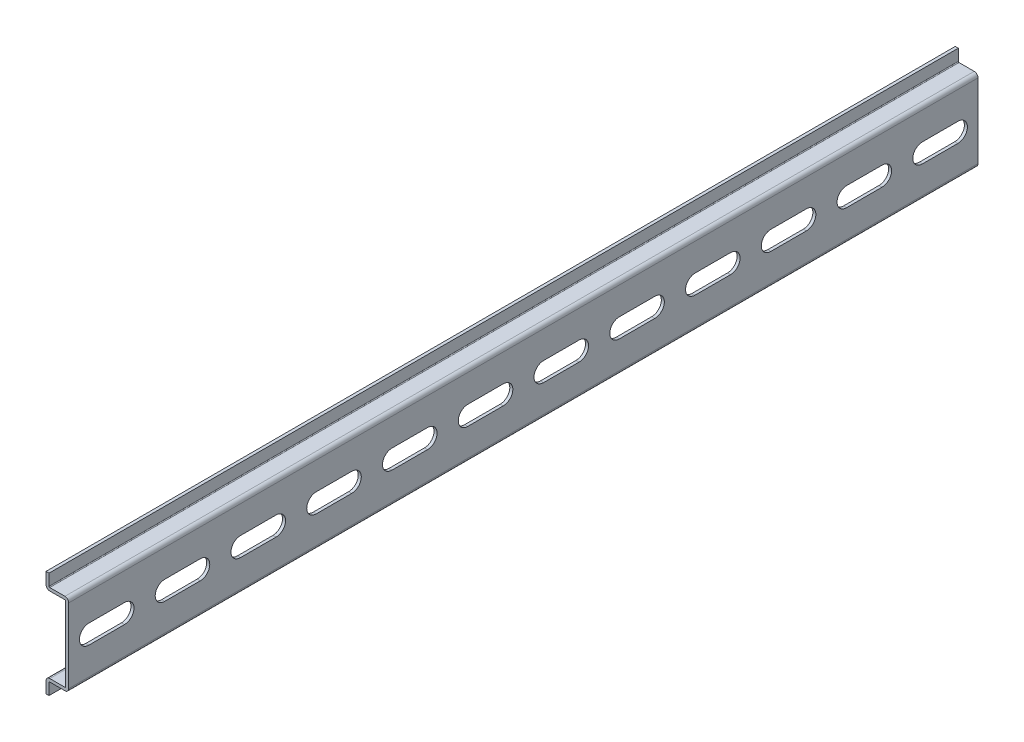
from build123d import *

# Parameters (mm, degrees)
EXTRUDE_THIN1_DEPTH = 300.0375
CUT_EXTRUDE1_DEPTH  = 301.640984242
LPATTERN1_COUNT     = 48
LPATTERN1_PITCH     = 25
FILLET1_R           = 0.25
FILLET2_R           = 1.25


with BuildPart() as part:
    # Sketch3 → Extrude-Thin1 (new body)
    with BuildSketch(Plane.XY):
        Polygon((-6.5, 17.5), (-6.5, 13.5), (0, 13.5), (0, -13.5), (-6.5, -13.5), (-6.5, -17.5), (-7.5, -17.5), (-7.5, -12.5), (-1, -12.5), (-1, 12.5), (-7.5, 12.5), (-7.5, 17.5), align=None)
    extrude(amount=EXTRUDE_THIN1_DEPTH)

    # Sketch4 → Cut-Extrude1 (cut, symmetric)
    with BuildSketch(Plane(origin=(0, 0, 0), x_dir=(0, 0, -1), z_dir=(1, 0, 0))):
        with BuildLine():
            Line((-6.65, -3.15), (-18.35, -3.15))
            ThreePointArc((-18.35, -3.15), (-21.5, 0), (-18.35, 3.15))
            Line((-18.35, 3.15), (-6.65, 3.15))
            ThreePointArc((-6.65, 3.15), (-3.5, 0), (-6.65, -3.15))
        make_face()
    cut_extrude1 = extrude(amount=CUT_EXTRUDE1_DEPTH, both=True, mode=Mode.SUBTRACT)

    # LPattern1: Cut-Extrude1 ×48
    with Locations(*[(0, 0, i * LPATTERN1_PITCH) for i in range(1, LPATTERN1_COUNT)]):
        add(cut_extrude1, mode=Mode.SUBTRACT)

    # Fillet1
    fillet1_edges = [part.edges().sort_by_distance(p)[0] for p in [
        (-6.5, 13.5, 150.01875),
        (-6.5, -13.5, 150.01875),
        (-1, -12.5, 150.01875),
        (-1, 12.5, 150.01875),
    ]]
    fillet(fillet1_edges, radius=FILLET1_R)

    # Fillet2
    fillet2_edges = [part.edges().sort_by_distance(p)[0] for p in [
        (0, 13.5, 150.01875),
        (0, -13.5, 150.01875),
        (-7.5, -12.5, 150.01875),
        (-7.5, 12.5, 150.01875),
    ]]
    fillet(fillet2_edges, radius=FILLET2_R)


solid = part.part
